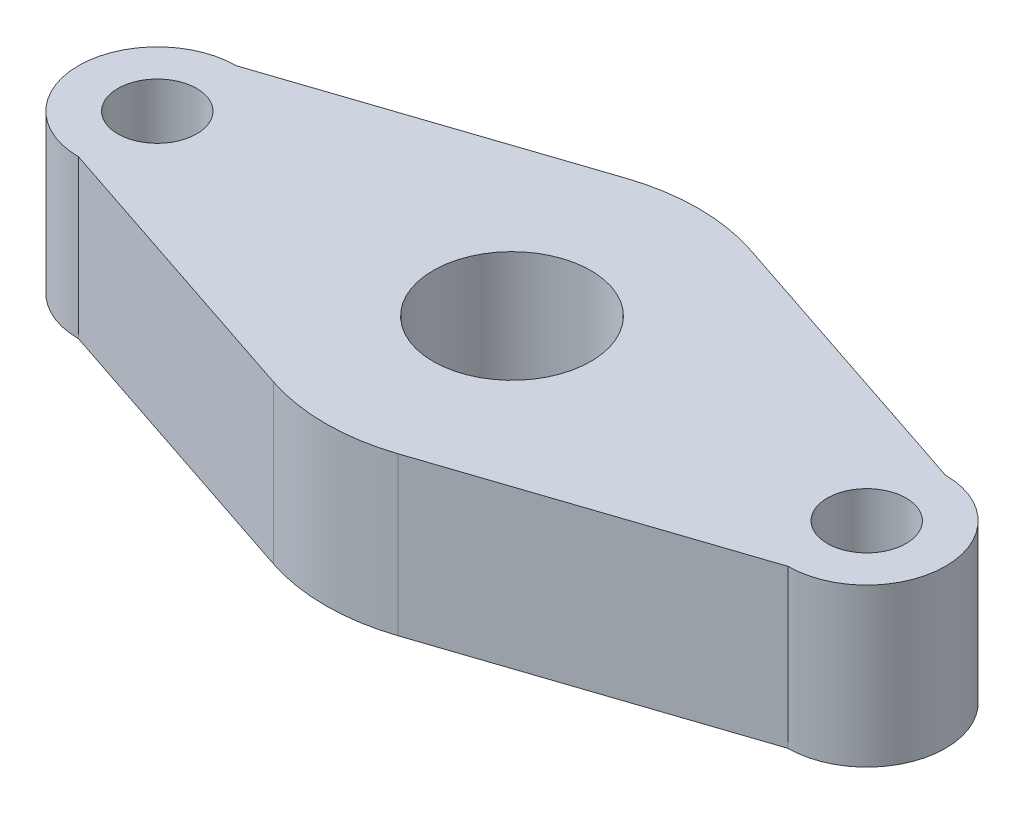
ISO-10303-21;
HEADER;
FILE_DESCRIPTION(('STEP AP214'),'2;1');
FILE_NAME('part.step','',(''),(''),'','','');
FILE_SCHEMA(('AUTOMOTIVE_DESIGN { 1 0 10303 214 1 1 1 1 }'));
ENDSEC;
DATA;
#1=APPLICATION_CONTEXT('core data for automotive mechanical design processes');
#2=APPLICATION_PROTOCOL_DEFINITION('international standard','automotive_design',2000,#1);
#3=PRODUCT_CONTEXT('',#1,'mechanical');
#4=PRODUCT('Part','Part','',(#3));
#5=PRODUCT_RELATED_PRODUCT_CATEGORY('part','',(#4));
#6=PRODUCT_DEFINITION_FORMATION('','',#4);
#7=PRODUCT_DEFINITION_CONTEXT('part definition',#1,'design');
#8=PRODUCT_DEFINITION('design','',#6,#7);
#9=PRODUCT_DEFINITION_SHAPE('','',#8);
#10=(LENGTH_UNIT() NAMED_UNIT(*) SI_UNIT(.MILLI.,.METRE.));
#11=(NAMED_UNIT(*) PLANE_ANGLE_UNIT() SI_UNIT($,.RADIAN.));
#12=(NAMED_UNIT(*) SI_UNIT($,.STERADIAN.) SOLID_ANGLE_UNIT());
#13=UNCERTAINTY_MEASURE_WITH_UNIT(LENGTH_MEASURE(1.E-05),#10,'distance_accuracy_value','');
#14=(GEOMETRIC_REPRESENTATION_CONTEXT(3) GLOBAL_UNCERTAINTY_ASSIGNED_CONTEXT((#13)) GLOBAL_UNIT_ASSIGNED_CONTEXT((#10,
#11,#12)) REPRESENTATION_CONTEXT('',''));
#15=CARTESIAN_POINT('',(0.,0.,0.));
#16=DIRECTION('',(0.,0.,1.));
#17=DIRECTION('',(1.,0.,0.));
#18=AXIS2_PLACEMENT_3D('',#15,#16,#17);
#19=CARTESIAN_POINT('',(57.15,25.4,0.));
#20=DIRECTION('',(0.,1.,0.));
#21=DIRECTION('',(0.,0.,1.));
#22=AXIS2_PLACEMENT_3D('',#19,#20,#21);
#23=PLANE('',#22);
#24=CARTESIAN_POINT('',(57.15,25.4,0.));
#25=DIRECTION('',(0.,1.,0.));
#26=DIRECTION('',(0.,0.,1.));
#27=AXIS2_PLACEMENT_3D('',#24,#25,#26);
#28=CIRCLE('',#27,6.35);
#29=CARTESIAN_POINT('',(57.15,25.4,6.35));
#30=VERTEX_POINT('',#29);
#31=EDGE_CURVE('E182',#30,#30,#28,.T.);
#32=ORIENTED_EDGE('',*,*,#31,.F.);
#33=EDGE_LOOP('',(#32));
#34=FACE_BOUND('',#33,.T.);
#35=CARTESIAN_POINT('',(57.15,25.4,0.));
#36=DIRECTION('',(0.,1.,0.));
#37=DIRECTION('',(0.,0.,1.));
#38=AXIS2_PLACEMENT_3D('',#35,#36,#37);
#39=CIRCLE('',#38,12.7);
#40=CARTESIAN_POINT('',(57.15,25.4,12.7));
#41=VERTEX_POINT('',#40);
#42=CARTESIAN_POINT('',(57.15,25.4,-12.7));
#43=VERTEX_POINT('',#42);
#44=EDGE_CURVE('E145',#41,#43,#39,.T.);
#45=ORIENTED_EDGE('',*,*,#44,.T.);
#46=DIRECTION('',(-0.948683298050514,0.,-0.316227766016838));
#47=VECTOR('',#46,1.);
#48=CARTESIAN_POINT('',(10.0402315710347,25.4,-28.4032561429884));
#49=LINE('',#48,#47);
#50=CARTESIAN_POINT('',(10.0402315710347,25.4,-28.4032561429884));
#51=VERTEX_POINT('',#50);
#52=EDGE_CURVE('E93',#43,#51,#49,.T.);
#53=ORIENTED_EDGE('',*,*,#52,.T.);
#54=CARTESIAN_POINT('',(0.,25.4,1.71743857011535));
#55=DIRECTION('',(0.,1.,0.));
#56=DIRECTION('',(0.,0.,-1.));
#57=AXIS2_PLACEMENT_3D('',#54,#55,#56);
#58=CIRCLE('',#57,31.75);
#59=CARTESIAN_POINT('',(-10.0402315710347,25.4,-28.4032561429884));
#60=VERTEX_POINT('',#59);
#61=EDGE_CURVE('E160',#51,#60,#58,.T.);
#62=ORIENTED_EDGE('',*,*,#61,.T.);
#63=DIRECTION('',(-0.948683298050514,0.,0.316227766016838));
#64=VECTOR('',#63,1.);
#65=CARTESIAN_POINT('',(-10.0402315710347,25.4,-28.4032561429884));
#66=LINE('',#65,#64);
#67=CARTESIAN_POINT('',(-57.15,25.4,-12.7));
#68=VERTEX_POINT('',#67);
#69=EDGE_CURVE('E173',#60,#68,#66,.T.);
#70=ORIENTED_EDGE('',*,*,#69,.T.);
#71=CARTESIAN_POINT('',(-57.15,25.4,0.));
#72=DIRECTION('',(0.,1.,0.));
#73=DIRECTION('',(0.,0.,-1.));
#74=AXIS2_PLACEMENT_3D('',#71,#72,#73);
#75=CIRCLE('',#74,12.7);
#76=CARTESIAN_POINT('',(-57.15,25.4,12.7));
#77=VERTEX_POINT('',#76);
#78=EDGE_CURVE('E112',#68,#77,#75,.T.);
#79=ORIENTED_EDGE('',*,*,#78,.T.);
#80=DIRECTION('',(0.948683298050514,0.,0.316227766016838));
#81=VECTOR('',#80,1.);
#82=CARTESIAN_POINT('',(-10.0402315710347,25.4,28.4032561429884));
#83=LINE('',#82,#81);
#84=CARTESIAN_POINT('',(-10.0402315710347,25.4,28.4032561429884));
#85=VERTEX_POINT('',#84);
#86=EDGE_CURVE('E106',#77,#85,#83,.T.);
#87=ORIENTED_EDGE('',*,*,#86,.T.);
#88=CARTESIAN_POINT('',(0.,25.4,-1.71743857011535));
#89=DIRECTION('',(0.,1.,0.));
#90=DIRECTION('',(0.,0.,1.));
#91=AXIS2_PLACEMENT_3D('',#88,#89,#90);
#92=CIRCLE('',#91,31.75);
#93=CARTESIAN_POINT('',(10.0402315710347,25.4,28.4032561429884));
#94=VERTEX_POINT('',#93);
#95=EDGE_CURVE('E110',#85,#94,#92,.T.);
#96=ORIENTED_EDGE('',*,*,#95,.T.);
#97=DIRECTION('',(0.948683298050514,0.,-0.316227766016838));
#98=VECTOR('',#97,1.);
#99=CARTESIAN_POINT('',(10.0402315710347,25.4,28.4032561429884));
#100=LINE('',#99,#98);
#101=EDGE_CURVE('E50',#94,#41,#100,.T.);
#102=ORIENTED_EDGE('',*,*,#101,.T.);
#103=EDGE_LOOP('',(#45,#53,#62,#70,#79,#87,#96,#102));
#104=FACE_BOUND('',#103,.T.);
#105=CARTESIAN_POINT('',(0.,25.4,0.));
#106=DIRECTION('',(0.,1.,0.));
#107=DIRECTION('',(0.,0.,1.));
#108=AXIS2_PLACEMENT_3D('',#105,#106,#107);
#109=CIRCLE('',#108,12.7);
#110=CARTESIAN_POINT('',(0.,25.4,12.7));
#111=VERTEX_POINT('',#110);
#112=EDGE_CURVE('E134',#111,#111,#109,.T.);
#113=ORIENTED_EDGE('',*,*,#112,.F.);
#114=EDGE_LOOP('',(#113));
#115=FACE_BOUND('',#114,.T.);
#116=CARTESIAN_POINT('',(-57.15,25.4,0.));
#117=DIRECTION('',(0.,1.,0.));
#118=DIRECTION('',(0.,0.,-1.));
#119=AXIS2_PLACEMENT_3D('',#116,#117,#118);
#120=CIRCLE('',#119,6.35);
#121=CARTESIAN_POINT('',(-57.15,25.4,-6.35));
#122=VERTEX_POINT('',#121);
#123=EDGE_CURVE('E188',#122,#122,#120,.T.);
#124=ORIENTED_EDGE('',*,*,#123,.F.);
#125=EDGE_LOOP('',(#124));
#126=FACE_BOUND('',#125,.T.);
#127=ADVANCED_FACE('F33',(#34,#104,#115,#126),#23,.T.);
#128=CARTESIAN_POINT('',(57.15,0.,0.));
#129=DIRECTION('',(0.,1.,0.));
#130=DIRECTION('',(0.,0.,1.));
#131=AXIS2_PLACEMENT_3D('',#128,#129,#130);
#132=PLANE('',#131);
#133=CARTESIAN_POINT('',(57.15,0.,0.));
#134=DIRECTION('',(0.,1.,0.));
#135=DIRECTION('',(0.,0.,1.));
#136=AXIS2_PLACEMENT_3D('',#133,#134,#135);
#137=CIRCLE('',#136,12.7);
#138=CARTESIAN_POINT('',(57.15,0.,12.7));
#139=VERTEX_POINT('',#138);
#140=CARTESIAN_POINT('',(57.15,0.,-12.7));
#141=VERTEX_POINT('',#140);
#142=EDGE_CURVE('E130',#139,#141,#137,.T.);
#143=ORIENTED_EDGE('',*,*,#142,.F.);
#144=DIRECTION('',(0.948683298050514,0.,-0.316227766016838));
#145=VECTOR('',#144,1.);
#146=CARTESIAN_POINT('',(10.0402315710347,0.,28.4032561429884));
#147=LINE('',#146,#145);
#148=CARTESIAN_POINT('',(10.0402315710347,0.,28.4032561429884));
#149=VERTEX_POINT('',#148);
#150=EDGE_CURVE('E85',#149,#139,#147,.T.);
#151=ORIENTED_EDGE('',*,*,#150,.F.);
#152=CARTESIAN_POINT('',(0.,0.,-1.71743857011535));
#153=DIRECTION('',(0.,1.,0.));
#154=DIRECTION('',(0.,0.,1.));
#155=AXIS2_PLACEMENT_3D('',#152,#153,#154);
#156=CIRCLE('',#155,31.75);
#157=CARTESIAN_POINT('',(-10.0402315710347,0.,28.4032561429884));
#158=VERTEX_POINT('',#157);
#159=EDGE_CURVE('E79',#158,#149,#156,.T.);
#160=ORIENTED_EDGE('',*,*,#159,.F.);
#161=DIRECTION('',(0.948683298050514,0.,0.316227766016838));
#162=VECTOR('',#161,1.);
#163=CARTESIAN_POINT('',(-10.0402315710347,0.,28.4032561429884));
#164=LINE('',#163,#162);
#165=CARTESIAN_POINT('',(-57.15,0.,12.7));
#166=VERTEX_POINT('',#165);
#167=EDGE_CURVE('E120',#166,#158,#164,.T.);
#168=ORIENTED_EDGE('',*,*,#167,.F.);
#169=CARTESIAN_POINT('',(-57.15,0.,0.));
#170=DIRECTION('',(0.,1.,0.));
#171=DIRECTION('',(0.,0.,-1.));
#172=AXIS2_PLACEMENT_3D('',#169,#170,#171);
#173=CIRCLE('',#172,12.7);
#174=CARTESIAN_POINT('',(-57.15,0.,-12.7));
#175=VERTEX_POINT('',#174);
#176=EDGE_CURVE('E140',#175,#166,#173,.T.);
#177=ORIENTED_EDGE('',*,*,#176,.F.);
#178=DIRECTION('',(-0.948683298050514,0.,0.316227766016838));
#179=VECTOR('',#178,1.);
#180=CARTESIAN_POINT('',(-10.0402315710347,0.,-28.4032561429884));
#181=LINE('',#180,#179);
#182=CARTESIAN_POINT('',(-10.0402315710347,0.,-28.4032561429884));
#183=VERTEX_POINT('',#182);
#184=EDGE_CURVE('E138',#183,#175,#181,.T.);
#185=ORIENTED_EDGE('',*,*,#184,.F.);
#186=CARTESIAN_POINT('',(0.,0.,1.71743857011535));
#187=DIRECTION('',(0.,1.,0.));
#188=DIRECTION('',(0.,0.,-1.));
#189=AXIS2_PLACEMENT_3D('',#186,#187,#188);
#190=CIRCLE('',#189,31.75);
#191=CARTESIAN_POINT('',(10.0402315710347,0.,-28.4032561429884));
#192=VERTEX_POINT('',#191);
#193=EDGE_CURVE('E136',#192,#183,#190,.T.);
#194=ORIENTED_EDGE('',*,*,#193,.F.);
#195=DIRECTION('',(-0.948683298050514,0.,-0.316227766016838));
#196=VECTOR('',#195,1.);
#197=CARTESIAN_POINT('',(10.0402315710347,0.,-28.4032561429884));
#198=LINE('',#197,#196);
#199=EDGE_CURVE('E133',#141,#192,#198,.T.);
#200=ORIENTED_EDGE('',*,*,#199,.F.);
#201=EDGE_LOOP('',(#143,#151,#160,#168,#177,#185,#194,#200));
#202=FACE_BOUND('',#201,.T.);
#203=CARTESIAN_POINT('',(0.,0.,0.));
#204=DIRECTION('',(0.,1.,0.));
#205=DIRECTION('',(0.,0.,1.));
#206=AXIS2_PLACEMENT_3D('',#203,#204,#205);
#207=CIRCLE('',#206,12.7);
#208=CARTESIAN_POINT('',(0.,0.,12.7));
#209=VERTEX_POINT('',#208);
#210=EDGE_CURVE('E179',#209,#209,#207,.T.);
#211=ORIENTED_EDGE('',*,*,#210,.T.);
#212=EDGE_LOOP('',(#211));
#213=FACE_BOUND('',#212,.T.);
#214=CARTESIAN_POINT('',(57.15,0.,0.));
#215=DIRECTION('',(0.,1.,0.));
#216=DIRECTION('',(0.,0.,1.));
#217=AXIS2_PLACEMENT_3D('',#214,#215,#216);
#218=CIRCLE('',#217,6.35);
#219=CARTESIAN_POINT('',(57.15,0.,6.35));
#220=VERTEX_POINT('',#219);
#221=EDGE_CURVE('E185',#220,#220,#218,.T.);
#222=ORIENTED_EDGE('',*,*,#221,.T.);
#223=EDGE_LOOP('',(#222));
#224=FACE_BOUND('',#223,.T.);
#225=CARTESIAN_POINT('',(-57.15,0.,0.));
#226=DIRECTION('',(0.,1.,0.));
#227=DIRECTION('',(0.,0.,-1.));
#228=AXIS2_PLACEMENT_3D('',#225,#226,#227);
#229=CIRCLE('',#228,6.35);
#230=CARTESIAN_POINT('',(-57.15,0.,-6.35));
#231=VERTEX_POINT('',#230);
#232=EDGE_CURVE('E191',#231,#231,#229,.T.);
#233=ORIENTED_EDGE('',*,*,#232,.T.);
#234=EDGE_LOOP('',(#233));
#235=FACE_BOUND('',#234,.T.);
#236=ADVANCED_FACE('F164',(#202,#213,#224,#235),#132,.F.);
#237=CARTESIAN_POINT('',(57.15,25.4,0.));
#238=DIRECTION('',(0.,-1.,0.));
#239=DIRECTION('',(0.,0.,-1.));
#240=AXIS2_PLACEMENT_3D('',#237,#238,#239);
#241=CYLINDRICAL_SURFACE('',#240,12.7);
#242=ORIENTED_EDGE('',*,*,#142,.T.);
#243=DIRECTION('',(0.,-1.,0.));
#244=VECTOR('',#243,1.);
#245=CARTESIAN_POINT('',(57.15,25.4,-12.7));
#246=LINE('',#245,#244);
#247=EDGE_CURVE('E11',#43,#141,#246,.T.);
#248=ORIENTED_EDGE('',*,*,#247,.F.);
#249=ORIENTED_EDGE('',*,*,#44,.F.);
#250=DIRECTION('',(0.,-1.,0.));
#251=VECTOR('',#250,1.);
#252=CARTESIAN_POINT('',(57.15,25.4,12.7));
#253=LINE('',#252,#251);
#254=EDGE_CURVE('E126',#41,#139,#253,.T.);
#255=ORIENTED_EDGE('',*,*,#254,.T.);
#256=EDGE_LOOP('',(#242,#248,#249,#255));
#257=FACE_BOUND('',#256,.T.);
#258=ADVANCED_FACE('F35',(#257),#241,.T.);
#259=CARTESIAN_POINT('',(10.0402315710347,25.4,-28.4032561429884));
#260=DIRECTION('',(-0.316227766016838,0.,0.948683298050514));
#261=DIRECTION('',(0.948683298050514,0.,0.316227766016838));
#262=AXIS2_PLACEMENT_3D('',#259,#260,#261);
#263=PLANE('',#262);
#264=ORIENTED_EDGE('',*,*,#199,.T.);
#265=DIRECTION('',(0.,-1.,0.));
#266=VECTOR('',#265,1.);
#267=CARTESIAN_POINT('',(10.0402315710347,25.4,-28.4032561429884));
#268=LINE('',#267,#266);
#269=EDGE_CURVE('E42',#51,#192,#268,.T.);
#270=ORIENTED_EDGE('',*,*,#269,.F.);
#271=ORIENTED_EDGE('',*,*,#52,.F.);
#272=ORIENTED_EDGE('',*,*,#247,.T.);
#273=EDGE_LOOP('',(#264,#270,#271,#272));
#274=FACE_BOUND('',#273,.T.);
#275=ADVANCED_FACE('F224',(#274),#263,.F.);
#276=CARTESIAN_POINT('',(0.,25.4,1.71743857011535));
#277=DIRECTION('',(0.,-1.,0.));
#278=DIRECTION('',(0.,0.,-1.));
#279=AXIS2_PLACEMENT_3D('',#276,#277,#278);
#280=CYLINDRICAL_SURFACE('',#279,31.75);
#281=ORIENTED_EDGE('',*,*,#193,.T.);
#282=DIRECTION('',(0.,-1.,0.));
#283=VECTOR('',#282,1.);
#284=CARTESIAN_POINT('',(-10.0402315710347,25.4,-28.4032561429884));
#285=LINE('',#284,#283);
#286=EDGE_CURVE('E152',#60,#183,#285,.T.);
#287=ORIENTED_EDGE('',*,*,#286,.F.);
#288=ORIENTED_EDGE('',*,*,#61,.F.);
#289=ORIENTED_EDGE('',*,*,#269,.T.);
#290=EDGE_LOOP('',(#281,#287,#288,#289));
#291=FACE_BOUND('',#290,.T.);
#292=ADVANCED_FACE('F158',(#291),#280,.T.);
#293=CARTESIAN_POINT('',(-10.0402315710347,25.4,-28.4032561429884));
#294=DIRECTION('',(0.316227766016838,0.,0.948683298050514));
#295=DIRECTION('',(0.948683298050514,0.,-0.316227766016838));
#296=AXIS2_PLACEMENT_3D('',#293,#294,#295);
#297=PLANE('',#296);
#298=ORIENTED_EDGE('',*,*,#184,.T.);
#299=DIRECTION('',(0.,-1.,0.));
#300=VECTOR('',#299,1.);
#301=CARTESIAN_POINT('',(-57.15,25.4,-12.7));
#302=LINE('',#301,#300);
#303=EDGE_CURVE('E149',#68,#175,#302,.T.);
#304=ORIENTED_EDGE('',*,*,#303,.F.);
#305=ORIENTED_EDGE('',*,*,#69,.F.);
#306=ORIENTED_EDGE('',*,*,#286,.T.);
#307=EDGE_LOOP('',(#298,#304,#305,#306));
#308=FACE_BOUND('',#307,.T.);
#309=ADVANCED_FACE('F169',(#308),#297,.F.);
#310=CARTESIAN_POINT('',(-57.15,25.4,0.));
#311=DIRECTION('',(0.,-1.,0.));
#312=DIRECTION('',(0.,0.,-1.));
#313=AXIS2_PLACEMENT_3D('',#310,#311,#312);
#314=CYLINDRICAL_SURFACE('',#313,12.7);
#315=ORIENTED_EDGE('',*,*,#176,.T.);
#316=DIRECTION('',(0.,-1.,0.));
#317=VECTOR('',#316,1.);
#318=CARTESIAN_POINT('',(-57.15,25.4,12.7));
#319=LINE('',#318,#317);
#320=EDGE_CURVE('E121',#77,#166,#319,.T.);
#321=ORIENTED_EDGE('',*,*,#320,.F.);
#322=ORIENTED_EDGE('',*,*,#78,.F.);
#323=ORIENTED_EDGE('',*,*,#303,.T.);
#324=EDGE_LOOP('',(#315,#321,#322,#323));
#325=FACE_BOUND('',#324,.T.);
#326=ADVANCED_FACE('F172',(#325),#314,.T.);
#327=CARTESIAN_POINT('',(-10.0402315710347,25.4,28.4032561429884));
#328=DIRECTION('',(0.316227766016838,0.,-0.948683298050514));
#329=DIRECTION('',(-0.948683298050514,0.,-0.316227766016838));
#330=AXIS2_PLACEMENT_3D('',#327,#328,#329);
#331=PLANE('',#330);
#332=ORIENTED_EDGE('',*,*,#167,.T.);
#333=DIRECTION('',(0.,-1.,0.));
#334=VECTOR('',#333,1.);
#335=CARTESIAN_POINT('',(-10.0402315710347,25.4,28.4032561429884));
#336=LINE('',#335,#334);
#337=EDGE_CURVE('E117',#85,#158,#336,.T.);
#338=ORIENTED_EDGE('',*,*,#337,.F.);
#339=ORIENTED_EDGE('',*,*,#86,.F.);
#340=ORIENTED_EDGE('',*,*,#320,.T.);
#341=EDGE_LOOP('',(#332,#338,#339,#340));
#342=FACE_BOUND('',#341,.T.);
#343=ADVANCED_FACE('F118',(#342),#331,.F.);
#344=CARTESIAN_POINT('',(0.,25.4,-1.71743857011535));
#345=DIRECTION('',(0.,-1.,0.));
#346=DIRECTION('',(0.,0.,-1.));
#347=AXIS2_PLACEMENT_3D('',#344,#345,#346);
#348=CYLINDRICAL_SURFACE('',#347,31.75);
#349=ORIENTED_EDGE('',*,*,#159,.T.);
#350=DIRECTION('',(0.,-1.,0.));
#351=VECTOR('',#350,1.);
#352=CARTESIAN_POINT('',(10.0402315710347,25.4,28.4032561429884));
#353=LINE('',#352,#351);
#354=EDGE_CURVE('E122',#94,#149,#353,.T.);
#355=ORIENTED_EDGE('',*,*,#354,.F.);
#356=ORIENTED_EDGE('',*,*,#95,.F.);
#357=ORIENTED_EDGE('',*,*,#337,.T.);
#358=EDGE_LOOP('',(#349,#355,#356,#357));
#359=FACE_BOUND('',#358,.T.);
#360=ADVANCED_FACE('F124',(#359),#348,.T.);
#361=CARTESIAN_POINT('',(10.0402315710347,25.4,28.4032561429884));
#362=DIRECTION('',(-0.316227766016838,0.,-0.948683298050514));
#363=DIRECTION('',(-0.948683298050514,0.,0.316227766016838));
#364=AXIS2_PLACEMENT_3D('',#361,#362,#363);
#365=PLANE('',#364);
#366=ORIENTED_EDGE('',*,*,#150,.T.);
#367=ORIENTED_EDGE('',*,*,#254,.F.);
#368=ORIENTED_EDGE('',*,*,#101,.F.);
#369=ORIENTED_EDGE('',*,*,#354,.T.);
#370=EDGE_LOOP('',(#366,#367,#368,#369));
#371=FACE_BOUND('',#370,.T.);
#372=ADVANCED_FACE('F212',(#371),#365,.F.);
#373=CARTESIAN_POINT('',(0.,25.4,0.));
#374=DIRECTION('',(0.,-1.,0.));
#375=DIRECTION('',(0.,0.,-1.));
#376=AXIS2_PLACEMENT_3D('',#373,#374,#375);
#377=CYLINDRICAL_SURFACE('',#376,12.7);
#378=ORIENTED_EDGE('',*,*,#112,.T.);
#379=EDGE_LOOP('',(#378));
#380=FACE_BOUND('',#379,.T.);
#381=ORIENTED_EDGE('',*,*,#210,.F.);
#382=EDGE_LOOP('',(#381));
#383=FACE_BOUND('',#382,.T.);
#384=ADVANCED_FACE('F209',(#380,#383),#377,.F.);
#385=CARTESIAN_POINT('',(57.15,25.4,0.));
#386=DIRECTION('',(0.,-1.,0.));
#387=DIRECTION('',(0.,0.,-1.));
#388=AXIS2_PLACEMENT_3D('',#385,#386,#387);
#389=CYLINDRICAL_SURFACE('',#388,6.35);
#390=ORIENTED_EDGE('',*,*,#31,.T.);
#391=EDGE_LOOP('',(#390));
#392=FACE_BOUND('',#391,.T.);
#393=ORIENTED_EDGE('',*,*,#221,.F.);
#394=EDGE_LOOP('',(#393));
#395=FACE_BOUND('',#394,.T.);
#396=ADVANCED_FACE('F288',(#392,#395),#389,.F.);
#397=CARTESIAN_POINT('',(-57.15,25.4,0.));
#398=DIRECTION('',(0.,-1.,0.));
#399=DIRECTION('',(0.,0.,-1.));
#400=AXIS2_PLACEMENT_3D('',#397,#398,#399);
#401=CYLINDRICAL_SURFACE('',#400,6.35);
#402=ORIENTED_EDGE('',*,*,#123,.T.);
#403=EDGE_LOOP('',(#402));
#404=FACE_BOUND('',#403,.T.);
#405=ORIENTED_EDGE('',*,*,#232,.F.);
#406=EDGE_LOOP('',(#405));
#407=FACE_BOUND('',#406,.T.);
#408=ADVANCED_FACE('F197',(#404,#407),#401,.F.);
#409=CLOSED_SHELL('',(#127,#236,#258,#275,#292,#309,#326,#343,#360,#372,#384,#396,#408));
#410=MANIFOLD_SOLID_BREP('B2',#409);
#411=ADVANCED_BREP_SHAPE_REPRESENTATION('',(#18,#410),#14);
#412=SHAPE_DEFINITION_REPRESENTATION(#9,#411);
ENDSEC;
END-ISO-10303-21;
